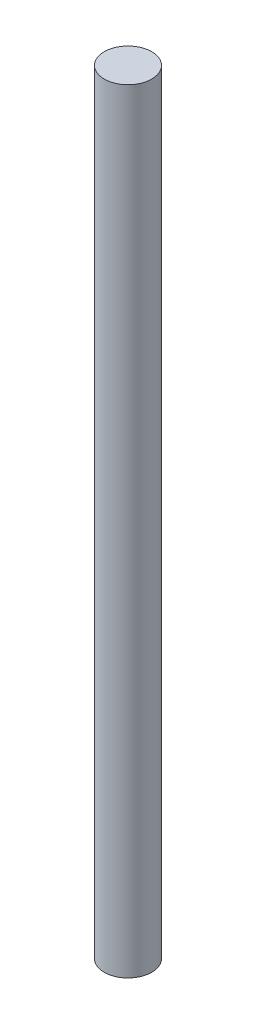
from build123d import *

# Parameters (mm, degrees)
SKETCH1_R      = 3.175
EXTRUDE1_DEPTH = 103.505


with BuildPart() as part:
    # Sketch1 → Extrude1 (new body)
    with BuildSketch(Plane(origin=(0, 0, 0), x_dir=(1, 0, 0), z_dir=(0, 1, 0))):
        with Locations(Location((0, 0, 0), (0, 0, 270))):
            Circle(SKETCH1_R)
    extrude(amount=-EXTRUDE1_DEPTH)


solid = part.part
